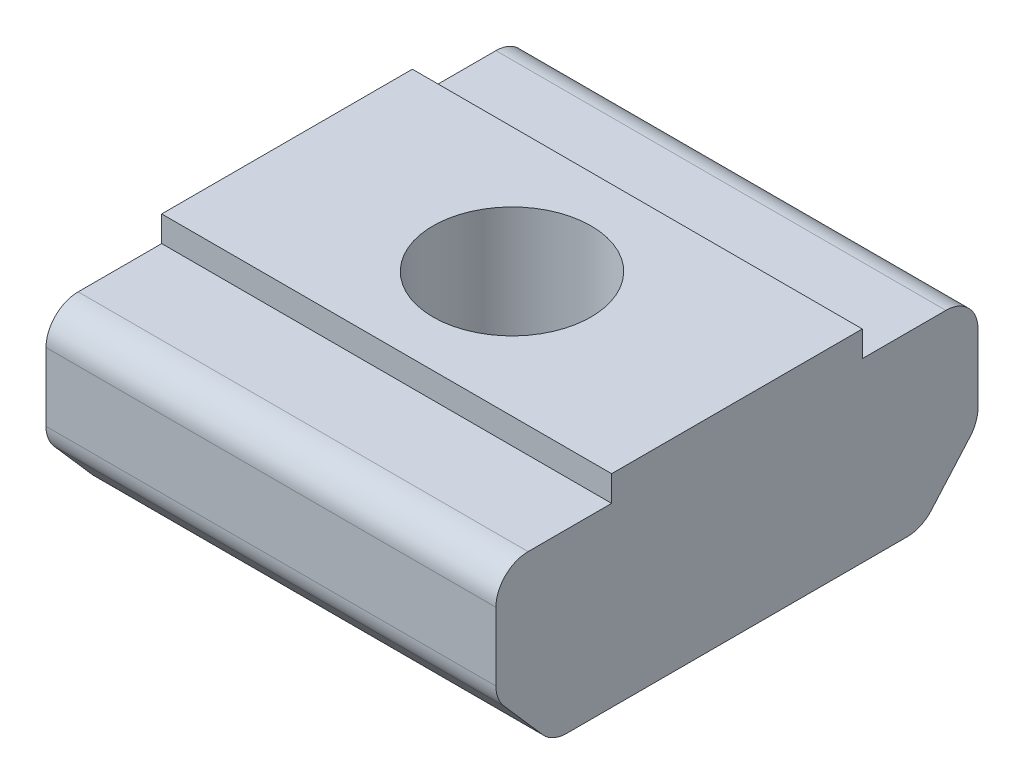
ISO-10303-21;
HEADER;
FILE_DESCRIPTION(('STEP AP214'),'2;1');
FILE_NAME('part.step','',(''),(''),'','','');
FILE_SCHEMA(('AUTOMOTIVE_DESIGN { 1 0 10303 214 1 1 1 1 }'));
ENDSEC;
DATA;
#1=APPLICATION_CONTEXT('core data for automotive mechanical design processes');
#2=APPLICATION_PROTOCOL_DEFINITION('international standard','automotive_design',2000,#1);
#3=PRODUCT_CONTEXT('',#1,'mechanical');
#4=PRODUCT('Part','Part','',(#3));
#5=PRODUCT_RELATED_PRODUCT_CATEGORY('part','',(#4));
#6=PRODUCT_DEFINITION_FORMATION('','',#4);
#7=PRODUCT_DEFINITION_CONTEXT('part definition',#1,'design');
#8=PRODUCT_DEFINITION('design','',#6,#7);
#9=PRODUCT_DEFINITION_SHAPE('','',#8);
#10=(LENGTH_UNIT() NAMED_UNIT(*) SI_UNIT(.MILLI.,.METRE.));
#11=(NAMED_UNIT(*) PLANE_ANGLE_UNIT() SI_UNIT($,.RADIAN.));
#12=(NAMED_UNIT(*) SI_UNIT($,.STERADIAN.) SOLID_ANGLE_UNIT());
#13=UNCERTAINTY_MEASURE_WITH_UNIT(LENGTH_MEASURE(1.E-05),#10,'distance_accuracy_value','');
#14=(GEOMETRIC_REPRESENTATION_CONTEXT(3) GLOBAL_UNCERTAINTY_ASSIGNED_CONTEXT((#13)) GLOBAL_UNIT_ASSIGNED_CONTEXT((#10,
#11,#12)) REPRESENTATION_CONTEXT('',''));
#15=CARTESIAN_POINT('',(0.,0.,0.));
#16=DIRECTION('',(0.,0.,1.));
#17=DIRECTION('',(1.,0.,0.));
#18=AXIS2_PLACEMENT_3D('',#15,#16,#17);
#19=CARTESIAN_POINT('',(7.,0.,3.9));
#20=DIRECTION('',(0.,-1.,0.));
#21=DIRECTION('',(0.,0.,-1.));
#22=AXIS2_PLACEMENT_3D('',#19,#20,#21);
#23=PLANE('',#22);
#24=DIRECTION('',(0.,0.,1.));
#25=VECTOR('',#24,1.);
#26=CARTESIAN_POINT('',(-7.,0.,3.9));
#27=LINE('',#26,#25);
#28=CARTESIAN_POINT('',(-7.,0.,-3.9));
#29=VERTEX_POINT('',#28);
#30=CARTESIAN_POINT('',(-7.,0.,3.9));
#31=VERTEX_POINT('',#30);
#32=EDGE_CURVE('E172',#29,#31,#27,.T.);
#33=ORIENTED_EDGE('',*,*,#32,.T.);
#34=DIRECTION('',(-1.,0.,0.));
#35=VECTOR('',#34,1.);
#36=CARTESIAN_POINT('',(7.,0.,3.9));
#37=LINE('',#36,#35);
#38=CARTESIAN_POINT('',(7.,0.,3.9));
#39=VERTEX_POINT('',#38);
#40=EDGE_CURVE('E253',#39,#31,#37,.T.);
#41=ORIENTED_EDGE('',*,*,#40,.F.);
#42=DIRECTION('',(0.,0.,1.));
#43=VECTOR('',#42,1.);
#44=CARTESIAN_POINT('',(7.,0.,3.9));
#45=LINE('',#44,#43);
#46=CARTESIAN_POINT('',(7.,0.,-3.9));
#47=VERTEX_POINT('',#46);
#48=EDGE_CURVE('E168',#47,#39,#45,.T.);
#49=ORIENTED_EDGE('',*,*,#48,.F.);
#50=DIRECTION('',(-1.,0.,0.));
#51=VECTOR('',#50,1.);
#52=CARTESIAN_POINT('',(7.,0.,-3.9));
#53=LINE('',#52,#51);
#54=EDGE_CURVE('E183',#47,#29,#53,.T.);
#55=ORIENTED_EDGE('',*,*,#54,.T.);
#56=EDGE_LOOP('',(#33,#41,#49,#55));
#57=FACE_BOUND('',#56,.T.);
#58=CARTESIAN_POINT('',(0.,0.,0.));
#59=DIRECTION('',(0.,1.,0.));
#60=DIRECTION('',(0.,0.,1.));
#61=AXIS2_PLACEMENT_3D('',#58,#59,#60);
#62=CIRCLE('',#61,2.4585);
#63=CARTESIAN_POINT('',(0.,0.,2.4585));
#64=VERTEX_POINT('',#63);
#65=EDGE_CURVE('E268',#64,#64,#62,.T.);
#66=ORIENTED_EDGE('',*,*,#65,.F.);
#67=EDGE_LOOP('',(#66));
#68=FACE_BOUND('',#67,.T.);
#69=ADVANCED_FACE('F37',(#57,#68),#23,.F.);
#70=CARTESIAN_POINT('',(7.,-0.800000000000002,3.9));
#71=DIRECTION('',(0.,0.,-1.));
#72=DIRECTION('',(-1.,0.,0.));
#73=AXIS2_PLACEMENT_3D('',#70,#71,#72);
#74=PLANE('',#73);
#75=DIRECTION('',(0.,-1.,0.));
#76=VECTOR('',#75,1.);
#77=CARTESIAN_POINT('',(-7.,-0.800000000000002,3.9));
#78=LINE('',#77,#76);
#79=CARTESIAN_POINT('',(-7.,-0.800000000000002,3.9));
#80=VERTEX_POINT('',#79);
#81=EDGE_CURVE('E176',#31,#80,#78,.T.);
#82=ORIENTED_EDGE('',*,*,#81,.T.);
#83=DIRECTION('',(-1.,0.,0.));
#84=VECTOR('',#83,1.);
#85=CARTESIAN_POINT('',(7.,-0.800000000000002,3.9));
#86=LINE('',#85,#84);
#87=CARTESIAN_POINT('',(7.,-0.800000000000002,3.9));
#88=VERTEX_POINT('',#87);
#89=EDGE_CURVE('E157',#88,#80,#86,.T.);
#90=ORIENTED_EDGE('',*,*,#89,.F.);
#91=DIRECTION('',(0.,-1.,0.));
#92=VECTOR('',#91,1.);
#93=CARTESIAN_POINT('',(7.,-0.800000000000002,3.9));
#94=LINE('',#93,#92);
#95=EDGE_CURVE('E163',#39,#88,#94,.T.);
#96=ORIENTED_EDGE('',*,*,#95,.F.);
#97=ORIENTED_EDGE('',*,*,#40,.T.);
#98=EDGE_LOOP('',(#82,#90,#96,#97));
#99=FACE_BOUND('',#98,.T.);
#100=ADVANCED_FACE('F174',(#99),#74,.F.);
#101=CARTESIAN_POINT('',(7.,-0.800000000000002,7.5));
#102=DIRECTION('',(0.,-1.,0.));
#103=DIRECTION('',(0.,0.,-1.));
#104=AXIS2_PLACEMENT_3D('',#101,#102,#103);
#105=PLANE('',#104);
#106=DIRECTION('',(0.,0.,1.));
#107=VECTOR('',#106,1.);
#108=CARTESIAN_POINT('',(-7.,-0.800000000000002,7.5));
#109=LINE('',#108,#107);
#110=CARTESIAN_POINT('',(-7.,-0.800000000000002,6.5));
#111=VERTEX_POINT('',#110);
#112=EDGE_CURVE('E262',#80,#111,#109,.T.);
#113=ORIENTED_EDGE('',*,*,#112,.T.);
#114=DIRECTION('',(-1.,0.,0.));
#115=VECTOR('',#114,1.);
#116=CARTESIAN_POINT('',(7.,-0.800000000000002,6.5));
#117=LINE('',#116,#115);
#118=CARTESIAN_POINT('',(7.,-0.800000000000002,6.5));
#119=VERTEX_POINT('',#118);
#120=EDGE_CURVE('E160',#111,#119,#117,.F.);
#121=ORIENTED_EDGE('',*,*,#120,.T.);
#122=DIRECTION('',(0.,0.,1.));
#123=VECTOR('',#122,1.);
#124=CARTESIAN_POINT('',(7.,-0.800000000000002,7.5));
#125=LINE('',#124,#123);
#126=EDGE_CURVE('E152',#88,#119,#125,.T.);
#127=ORIENTED_EDGE('',*,*,#126,.F.);
#128=ORIENTED_EDGE('',*,*,#89,.T.);
#129=EDGE_LOOP('',(#113,#121,#127,#128));
#130=FACE_BOUND('',#129,.T.);
#131=ADVANCED_FACE('F155',(#130),#105,.F.);
#132=CARTESIAN_POINT('',(7.,-0.800000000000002,7.5));
#133=DIRECTION('',(0.,0.,-1.));
#134=DIRECTION('',(0.,1.,0.));
#135=AXIS2_PLACEMENT_3D('',#132,#133,#134);
#136=PLANE('',#135);
#137=DIRECTION('',(0.,-1.,0.));
#138=VECTOR('',#137,1.);
#139=CARTESIAN_POINT('',(7.,-0.800000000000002,7.5));
#140=LINE('',#139,#138);
#141=CARTESIAN_POINT('',(7.,-1.8,7.5));
#142=VERTEX_POINT('',#141);
#143=CARTESIAN_POINT('',(7.,-3.92426488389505,7.5));
#144=VERTEX_POINT('',#143);
#145=EDGE_CURVE('E162',#142,#144,#140,.T.);
#146=ORIENTED_EDGE('',*,*,#145,.F.);
#147=DIRECTION('',(-1.,0.,0.));
#148=VECTOR('',#147,1.);
#149=CARTESIAN_POINT('',(7.,-1.8,7.5));
#150=LINE('',#149,#148);
#151=CARTESIAN_POINT('',(-7.,-1.8,7.5));
#152=VERTEX_POINT('',#151);
#153=EDGE_CURVE('E180',#142,#152,#150,.T.);
#154=ORIENTED_EDGE('',*,*,#153,.T.);
#155=DIRECTION('',(0.,-1.,0.));
#156=VECTOR('',#155,1.);
#157=CARTESIAN_POINT('',(-7.,-0.800000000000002,7.5));
#158=LINE('',#157,#156);
#159=CARTESIAN_POINT('',(-7.,-3.92426488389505,7.5));
#160=VERTEX_POINT('',#159);
#161=EDGE_CURVE('E265',#152,#160,#158,.T.);
#162=ORIENTED_EDGE('',*,*,#161,.T.);
#163=DIRECTION('',(-1.,0.,0.));
#164=VECTOR('',#163,1.);
#165=CARTESIAN_POINT('',(7.,-3.92426488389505,7.5));
#166=LINE('',#165,#164);
#167=EDGE_CURVE('E177',#160,#144,#166,.F.);
#168=ORIENTED_EDGE('',*,*,#167,.T.);
#169=EDGE_LOOP('',(#146,#154,#162,#168));
#170=FACE_BOUND('',#169,.T.);
#171=ADVANCED_FACE('F342',(#170),#136,.F.);
#172=CARTESIAN_POINT('',(7.,-4.3,7.5));
#173=DIRECTION('',(0.,0.658504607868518,-0.752576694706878));
#174=DIRECTION('',(0.,0.752576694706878,0.658504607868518));
#175=AXIS2_PLACEMENT_3D('',#172,#173,#174);
#176=PLANE('',#175);
#177=DIRECTION('',(0.,-0.752576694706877,-0.658504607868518));
#178=VECTOR('',#177,1.);
#179=CARTESIAN_POINT('',(7.,-4.3,7.5));
#180=LINE('',#179,#178);
#181=CARTESIAN_POINT('',(7.,-4.58276949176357,7.25257669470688));
#182=VERTEX_POINT('',#181);
#183=CARTESIAN_POINT('',(7.,-5.95850460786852,6.04880846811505));
#184=VERTEX_POINT('',#183);
#185=EDGE_CURVE('E299',#182,#184,#180,.T.);
#186=ORIENTED_EDGE('',*,*,#185,.F.);
#187=DIRECTION('',(-1.,0.,0.));
#188=VECTOR('',#187,1.);
#189=CARTESIAN_POINT('',(7.,-4.58276949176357,7.25257669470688));
#190=LINE('',#189,#188);
#191=CARTESIAN_POINT('',(-7.,-4.58276949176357,7.25257669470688));
#192=VERTEX_POINT('',#191);
#193=EDGE_CURVE('E215',#182,#192,#190,.T.);
#194=ORIENTED_EDGE('',*,*,#193,.T.);
#195=DIRECTION('',(0.,-0.752576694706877,-0.658504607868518));
#196=VECTOR('',#195,1.);
#197=CARTESIAN_POINT('',(-7.,-4.3,7.5));
#198=LINE('',#197,#196);
#199=CARTESIAN_POINT('',(-7.,-5.95850460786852,6.04880846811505));
#200=VERTEX_POINT('',#199);
#201=EDGE_CURVE('E275',#192,#200,#198,.T.);
#202=ORIENTED_EDGE('',*,*,#201,.T.);
#203=DIRECTION('',(-1.,0.,0.));
#204=VECTOR('',#203,1.);
#205=CARTESIAN_POINT('',(7.,-5.95850460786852,6.04880846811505));
#206=LINE('',#205,#204);
#207=EDGE_CURVE('E213',#200,#184,#206,.F.);
#208=ORIENTED_EDGE('',*,*,#207,.T.);
#209=EDGE_LOOP('',(#186,#194,#202,#208));
#210=FACE_BOUND('',#209,.T.);
#211=ADVANCED_FACE('F338',(#210),#176,.F.);
#212=CARTESIAN_POINT('',(7.,-6.3,-5.75));
#213=DIRECTION('',(0.,1.,0.));
#214=DIRECTION('',(0.,0.,1.));
#215=AXIS2_PLACEMENT_3D('',#212,#213,#214);
#216=PLANE('',#215);
#217=CARTESIAN_POINT('',(0.,-6.3,0.));
#218=DIRECTION('',(0.,1.,0.));
#219=DIRECTION('',(0.,0.,1.));
#220=AXIS2_PLACEMENT_3D('',#217,#218,#219);
#221=CIRCLE('',#220,2.4585);
#222=CARTESIAN_POINT('',(0.,-6.3,2.4585));
#223=VERTEX_POINT('',#222);
#224=EDGE_CURVE('E263',#223,#223,#221,.T.);
#225=ORIENTED_EDGE('',*,*,#224,.T.);
#226=EDGE_LOOP('',(#225));
#227=FACE_BOUND('',#226,.T.);
#228=DIRECTION('',(0.,0.,-1.));
#229=VECTOR('',#228,1.);
#230=CARTESIAN_POINT('',(7.,-6.3,-5.75));
#231=LINE('',#230,#229);
#232=CARTESIAN_POINT('',(7.,-6.3,5.29623177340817));
#233=VERTEX_POINT('',#232);
#234=CARTESIAN_POINT('',(7.,-6.3,-5.29623177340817));
#235=VERTEX_POINT('',#234);
#236=EDGE_CURVE('E292',#233,#235,#231,.T.);
#237=ORIENTED_EDGE('',*,*,#236,.F.);
#238=DIRECTION('',(-1.,0.,0.));
#239=VECTOR('',#238,1.);
#240=CARTESIAN_POINT('',(7.,-6.3,5.29623177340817));
#241=LINE('',#240,#239);
#242=CARTESIAN_POINT('',(-7.,-6.3,5.29623177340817));
#243=VERTEX_POINT('',#242);
#244=EDGE_CURVE('E220',#233,#243,#241,.T.);
#245=ORIENTED_EDGE('',*,*,#244,.T.);
#246=DIRECTION('',(0.,0.,-1.));
#247=VECTOR('',#246,1.);
#248=CARTESIAN_POINT('',(-7.,-6.3,-5.75));
#249=LINE('',#248,#247);
#250=CARTESIAN_POINT('',(-7.,-6.3,-5.29623177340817));
#251=VERTEX_POINT('',#250);
#252=EDGE_CURVE('E247',#243,#251,#249,.T.);
#253=ORIENTED_EDGE('',*,*,#252,.T.);
#254=DIRECTION('',(-1.,0.,0.));
#255=VECTOR('',#254,1.);
#256=CARTESIAN_POINT('',(7.,-6.3,-5.29623177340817));
#257=LINE('',#256,#255);
#258=EDGE_CURVE('E218',#251,#235,#257,.F.);
#259=ORIENTED_EDGE('',*,*,#258,.T.);
#260=EDGE_LOOP('',(#237,#245,#253,#259));
#261=FACE_BOUND('',#260,.T.);
#262=ADVANCED_FACE('F282',(#227,#261),#216,.F.);
#263=CARTESIAN_POINT('',(7.,-4.3,-7.5));
#264=DIRECTION('',(0.,0.658504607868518,0.752576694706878));
#265=DIRECTION('',(0.,-0.752576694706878,0.658504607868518));
#266=AXIS2_PLACEMENT_3D('',#263,#264,#265);
#267=PLANE('',#266);
#268=DIRECTION('',(0.,0.752576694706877,-0.658504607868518));
#269=VECTOR('',#268,1.);
#270=CARTESIAN_POINT('',(7.,-4.3,-7.5));
#271=LINE('',#270,#269);
#272=CARTESIAN_POINT('',(7.,-5.95850460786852,-6.04880846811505));
#273=VERTEX_POINT('',#272);
#274=CARTESIAN_POINT('',(7.,-4.58276949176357,-7.25257669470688));
#275=VERTEX_POINT('',#274);
#276=EDGE_CURVE('E291',#273,#275,#271,.T.);
#277=ORIENTED_EDGE('',*,*,#276,.F.);
#278=DIRECTION('',(-1.,0.,0.));
#279=VECTOR('',#278,1.);
#280=CARTESIAN_POINT('',(7.,-5.95850460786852,-6.04880846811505));
#281=LINE('',#280,#279);
#282=CARTESIAN_POINT('',(-7.,-5.95850460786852,-6.04880846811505));
#283=VERTEX_POINT('',#282);
#284=EDGE_CURVE('E225',#273,#283,#281,.T.);
#285=ORIENTED_EDGE('',*,*,#284,.T.);
#286=DIRECTION('',(0.,0.752576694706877,-0.658504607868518));
#287=VECTOR('',#286,1.);
#288=CARTESIAN_POINT('',(-7.,-4.3,-7.5));
#289=LINE('',#288,#287);
#290=CARTESIAN_POINT('',(-7.,-4.58276949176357,-7.25257669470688));
#291=VERTEX_POINT('',#290);
#292=EDGE_CURVE('E243',#283,#291,#289,.T.);
#293=ORIENTED_EDGE('',*,*,#292,.T.);
#294=DIRECTION('',(-1.,0.,0.));
#295=VECTOR('',#294,1.);
#296=CARTESIAN_POINT('',(7.,-4.58276949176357,-7.25257669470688));
#297=LINE('',#296,#295);
#298=EDGE_CURVE('E223',#291,#275,#297,.F.);
#299=ORIENTED_EDGE('',*,*,#298,.T.);
#300=EDGE_LOOP('',(#277,#285,#293,#299));
#301=FACE_BOUND('',#300,.T.);
#302=ADVANCED_FACE('F294',(#301),#267,.F.);
#303=CARTESIAN_POINT('',(7.,-0.8,-7.5));
#304=DIRECTION('',(0.,0.,1.));
#305=DIRECTION('',(0.,-1.,0.));
#306=AXIS2_PLACEMENT_3D('',#303,#304,#305);
#307=PLANE('',#306);
#308=DIRECTION('',(0.,1.,0.));
#309=VECTOR('',#308,1.);
#310=CARTESIAN_POINT('',(7.,-0.8,-7.5));
#311=LINE('',#310,#309);
#312=CARTESIAN_POINT('',(7.,-3.92426488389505,-7.5));
#313=VERTEX_POINT('',#312);
#314=CARTESIAN_POINT('',(7.,-1.8,-7.5));
#315=VERTEX_POINT('',#314);
#316=EDGE_CURVE('E233',#313,#315,#311,.T.);
#317=ORIENTED_EDGE('',*,*,#316,.F.);
#318=DIRECTION('',(-1.,0.,0.));
#319=VECTOR('',#318,1.);
#320=CARTESIAN_POINT('',(7.,-3.92426488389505,-7.5));
#321=LINE('',#320,#319);
#322=CARTESIAN_POINT('',(-7.,-3.92426488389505,-7.5));
#323=VERTEX_POINT('',#322);
#324=EDGE_CURVE('E45',#313,#323,#321,.T.);
#325=ORIENTED_EDGE('',*,*,#324,.T.);
#326=DIRECTION('',(0.,1.,0.));
#327=VECTOR('',#326,1.);
#328=CARTESIAN_POINT('',(-7.,-0.8,-7.5));
#329=LINE('',#328,#327);
#330=CARTESIAN_POINT('',(-7.,-1.8,-7.5));
#331=VERTEX_POINT('',#330);
#332=EDGE_CURVE('E232',#323,#331,#329,.T.);
#333=ORIENTED_EDGE('',*,*,#332,.T.);
#334=DIRECTION('',(-1.,0.,0.));
#335=VECTOR('',#334,1.);
#336=CARTESIAN_POINT('',(7.,-1.8,-7.5));
#337=LINE('',#336,#335);
#338=EDGE_CURVE('E60',#331,#315,#337,.F.);
#339=ORIENTED_EDGE('',*,*,#338,.T.);
#340=EDGE_LOOP('',(#317,#325,#333,#339));
#341=FACE_BOUND('',#340,.T.);
#342=ADVANCED_FACE('F231',(#341),#307,.F.);
#343=CARTESIAN_POINT('',(7.,-0.800000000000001,-3.9));
#344=DIRECTION('',(0.,-1.,0.));
#345=DIRECTION('',(0.,0.,-1.));
#346=AXIS2_PLACEMENT_3D('',#343,#344,#345);
#347=PLANE('',#346);
#348=DIRECTION('',(0.,0.,1.));
#349=VECTOR('',#348,1.);
#350=CARTESIAN_POINT('',(7.,-0.800000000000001,-3.9));
#351=LINE('',#350,#349);
#352=CARTESIAN_POINT('',(7.,-0.8,-6.5));
#353=VERTEX_POINT('',#352);
#354=CARTESIAN_POINT('',(7.,-0.800000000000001,-3.9));
#355=VERTEX_POINT('',#354);
#356=EDGE_CURVE('E297',#353,#355,#351,.T.);
#357=ORIENTED_EDGE('',*,*,#356,.F.);
#358=DIRECTION('',(-1.,0.,0.));
#359=VECTOR('',#358,1.);
#360=CARTESIAN_POINT('',(7.,-0.8,-6.5));
#361=LINE('',#360,#359);
#362=CARTESIAN_POINT('',(-7.,-0.8,-6.5));
#363=VERTEX_POINT('',#362);
#364=EDGE_CURVE('E11',#353,#363,#361,.T.);
#365=ORIENTED_EDGE('',*,*,#364,.T.);
#366=DIRECTION('',(0.,0.,1.));
#367=VECTOR('',#366,1.);
#368=CARTESIAN_POINT('',(-7.,-0.800000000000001,-3.9));
#369=LINE('',#368,#367);
#370=CARTESIAN_POINT('',(-7.,-0.800000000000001,-3.9));
#371=VERTEX_POINT('',#370);
#372=EDGE_CURVE('E242',#363,#371,#369,.T.);
#373=ORIENTED_EDGE('',*,*,#372,.T.);
#374=DIRECTION('',(-1.,0.,0.));
#375=VECTOR('',#374,1.);
#376=CARTESIAN_POINT('',(7.,-0.800000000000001,-3.9));
#377=LINE('',#376,#375);
#378=EDGE_CURVE('E178',#355,#371,#377,.T.);
#379=ORIENTED_EDGE('',*,*,#378,.F.);
#380=EDGE_LOOP('',(#357,#365,#373,#379));
#381=FACE_BOUND('',#380,.T.);
#382=ADVANCED_FACE('F307',(#381),#347,.F.);
#383=CARTESIAN_POINT('',(7.,0.,-3.9));
#384=DIRECTION('',(0.,0.,1.));
#385=DIRECTION('',(1.,0.,0.));
#386=AXIS2_PLACEMENT_3D('',#383,#384,#385);
#387=PLANE('',#386);
#388=DIRECTION('',(0.,1.,0.));
#389=VECTOR('',#388,1.);
#390=CARTESIAN_POINT('',(-7.,0.,-3.9));
#391=LINE('',#390,#389);
#392=EDGE_CURVE('E245',#371,#29,#391,.T.);
#393=ORIENTED_EDGE('',*,*,#392,.T.);
#394=ORIENTED_EDGE('',*,*,#54,.F.);
#395=DIRECTION('',(0.,1.,0.));
#396=VECTOR('',#395,1.);
#397=CARTESIAN_POINT('',(7.,0.,-3.9));
#398=LINE('',#397,#396);
#399=EDGE_CURVE('E303',#355,#47,#398,.T.);
#400=ORIENTED_EDGE('',*,*,#399,.F.);
#401=ORIENTED_EDGE('',*,*,#378,.T.);
#402=EDGE_LOOP('',(#393,#394,#400,#401));
#403=FACE_BOUND('',#402,.T.);
#404=ADVANCED_FACE('F305',(#403),#387,.F.);
#405=CARTESIAN_POINT('',(7.,0.,0.));
#406=DIRECTION('',(-1.,0.,0.));
#407=DIRECTION('',(0.,0.,1.));
#408=AXIS2_PLACEMENT_3D('',#405,#406,#407);
#409=PLANE('',#408);
#410=ORIENTED_EDGE('',*,*,#126,.T.);
#411=CARTESIAN_POINT('',(7.,-1.8,6.5));
#412=DIRECTION('',(-1.,0.,0.));
#413=DIRECTION('',(0.,0.,1.));
#414=AXIS2_PLACEMENT_3D('',#411,#412,#413);
#415=CIRCLE('',#414,1.);
#416=EDGE_CURVE('E211',#119,#142,#415,.F.);
#417=ORIENTED_EDGE('',*,*,#416,.T.);
#418=ORIENTED_EDGE('',*,*,#145,.T.);
#419=CARTESIAN_POINT('',(7.,-3.92426488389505,6.5));
#420=DIRECTION('',(-1.,0.,0.));
#421=DIRECTION('',(0.,0.,1.));
#422=AXIS2_PLACEMENT_3D('',#419,#420,#421);
#423=CIRCLE('',#422,1.);
#424=EDGE_CURVE('E209',#144,#182,#423,.F.);
#425=ORIENTED_EDGE('',*,*,#424,.T.);
#426=ORIENTED_EDGE('',*,*,#185,.T.);
#427=CARTESIAN_POINT('',(7.,-5.3,5.29623177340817));
#428=DIRECTION('',(-1.,0.,0.));
#429=DIRECTION('',(0.,0.,1.));
#430=AXIS2_PLACEMENT_3D('',#427,#428,#429);
#431=CIRCLE('',#430,1.);
#432=EDGE_CURVE('E207',#184,#233,#431,.F.);
#433=ORIENTED_EDGE('',*,*,#432,.T.);
#434=ORIENTED_EDGE('',*,*,#236,.T.);
#435=CARTESIAN_POINT('',(7.,-5.3,-5.29623177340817));
#436=DIRECTION('',(-1.,0.,0.));
#437=DIRECTION('',(0.,0.,1.));
#438=AXIS2_PLACEMENT_3D('',#435,#436,#437);
#439=CIRCLE('',#438,1.);
#440=EDGE_CURVE('E205',#235,#273,#439,.F.);
#441=ORIENTED_EDGE('',*,*,#440,.T.);
#442=ORIENTED_EDGE('',*,*,#276,.T.);
#443=CARTESIAN_POINT('',(7.,-3.92426488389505,-6.5));
#444=DIRECTION('',(-1.,0.,0.));
#445=DIRECTION('',(0.,0.,1.));
#446=AXIS2_PLACEMENT_3D('',#443,#444,#445);
#447=CIRCLE('',#446,1.);
#448=EDGE_CURVE('E203',#275,#313,#447,.F.);
#449=ORIENTED_EDGE('',*,*,#448,.T.);
#450=ORIENTED_EDGE('',*,*,#316,.T.);
#451=CARTESIAN_POINT('',(7.,-1.8,-6.5));
#452=DIRECTION('',(-1.,0.,0.));
#453=DIRECTION('',(0.,0.,1.));
#454=AXIS2_PLACEMENT_3D('',#451,#452,#453);
#455=CIRCLE('',#454,1.);
#456=EDGE_CURVE('E52',#315,#353,#455,.F.);
#457=ORIENTED_EDGE('',*,*,#456,.T.);
#458=ORIENTED_EDGE('',*,*,#356,.T.);
#459=ORIENTED_EDGE('',*,*,#399,.T.);
#460=ORIENTED_EDGE('',*,*,#48,.T.);
#461=ORIENTED_EDGE('',*,*,#95,.T.);
#462=EDGE_LOOP('',(#410,#417,#418,#425,#426,#433,#434,#441,#442,#449,#450,#457,#458,#459,#460,#461));
#463=FACE_BOUND('',#462,.T.);
#464=ADVANCED_FACE('F166',(#463),#409,.F.);
#465=CARTESIAN_POINT('',(-7.,0.,0.));
#466=DIRECTION('',(-1.,0.,0.));
#467=DIRECTION('',(0.,0.,1.));
#468=AXIS2_PLACEMENT_3D('',#465,#466,#467);
#469=PLANE('',#468);
#470=ORIENTED_EDGE('',*,*,#161,.F.);
#471=CARTESIAN_POINT('',(-7.,-1.8,6.5));
#472=DIRECTION('',(-1.,0.,0.));
#473=DIRECTION('',(0.,0.,1.));
#474=AXIS2_PLACEMENT_3D('',#471,#472,#473);
#475=CIRCLE('',#474,1.);
#476=EDGE_CURVE('E199',#152,#111,#475,.T.);
#477=ORIENTED_EDGE('',*,*,#476,.T.);
#478=ORIENTED_EDGE('',*,*,#112,.F.);
#479=ORIENTED_EDGE('',*,*,#81,.F.);
#480=ORIENTED_EDGE('',*,*,#32,.F.);
#481=ORIENTED_EDGE('',*,*,#392,.F.);
#482=ORIENTED_EDGE('',*,*,#372,.F.);
#483=CARTESIAN_POINT('',(-7.,-1.8,-6.5));
#484=DIRECTION('',(-1.,0.,0.));
#485=DIRECTION('',(0.,0.,1.));
#486=AXIS2_PLACEMENT_3D('',#483,#484,#485);
#487=CIRCLE('',#486,1.);
#488=EDGE_CURVE('E189',#363,#331,#487,.T.);
#489=ORIENTED_EDGE('',*,*,#488,.T.);
#490=ORIENTED_EDGE('',*,*,#332,.F.);
#491=CARTESIAN_POINT('',(-7.,-3.92426488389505,-6.5));
#492=DIRECTION('',(-1.,0.,0.));
#493=DIRECTION('',(0.,0.,1.));
#494=AXIS2_PLACEMENT_3D('',#491,#492,#493);
#495=CIRCLE('',#494,1.);
#496=EDGE_CURVE('E191',#323,#291,#495,.T.);
#497=ORIENTED_EDGE('',*,*,#496,.T.);
#498=ORIENTED_EDGE('',*,*,#292,.F.);
#499=CARTESIAN_POINT('',(-7.,-5.3,-5.29623177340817));
#500=DIRECTION('',(-1.,0.,0.));
#501=DIRECTION('',(0.,0.,1.));
#502=AXIS2_PLACEMENT_3D('',#499,#500,#501);
#503=CIRCLE('',#502,1.);
#504=EDGE_CURVE('E193',#283,#251,#503,.T.);
#505=ORIENTED_EDGE('',*,*,#504,.T.);
#506=ORIENTED_EDGE('',*,*,#252,.F.);
#507=CARTESIAN_POINT('',(-7.,-5.3,5.29623177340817));
#508=DIRECTION('',(-1.,0.,0.));
#509=DIRECTION('',(0.,0.,1.));
#510=AXIS2_PLACEMENT_3D('',#507,#508,#509);
#511=CIRCLE('',#510,1.);
#512=EDGE_CURVE('E195',#243,#200,#511,.T.);
#513=ORIENTED_EDGE('',*,*,#512,.T.);
#514=ORIENTED_EDGE('',*,*,#201,.F.);
#515=CARTESIAN_POINT('',(-7.,-3.92426488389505,6.5));
#516=DIRECTION('',(-1.,0.,0.));
#517=DIRECTION('',(0.,0.,1.));
#518=AXIS2_PLACEMENT_3D('',#515,#516,#517);
#519=CIRCLE('',#518,1.);
#520=EDGE_CURVE('E197',#192,#160,#519,.T.);
#521=ORIENTED_EDGE('',*,*,#520,.T.);
#522=EDGE_LOOP('',(#470,#477,#478,#479,#480,#481,#482,#489,#490,#497,#498,#505,#506,#513,#514,#521));
#523=FACE_BOUND('',#522,.T.);
#524=ADVANCED_FACE('F238',(#523),#469,.T.);
#525=CARTESIAN_POINT('',(7.,-1.8,6.5));
#526=DIRECTION('',(-1.,0.,0.));
#527=DIRECTION('',(0.,0.,1.));
#528=AXIS2_PLACEMENT_3D('',#525,#526,#527);
#529=CYLINDRICAL_SURFACE('',#528,1.);
#530=ORIENTED_EDGE('',*,*,#416,.F.);
#531=ORIENTED_EDGE('',*,*,#120,.F.);
#532=ORIENTED_EDGE('',*,*,#476,.F.);
#533=ORIENTED_EDGE('',*,*,#153,.F.);
#534=EDGE_LOOP('',(#530,#531,#532,#533));
#535=FACE_BOUND('',#534,.T.);
#536=ADVANCED_FACE('F349',(#535),#529,.T.);
#537=CARTESIAN_POINT('',(7.,-3.92426488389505,6.5));
#538=DIRECTION('',(-1.,0.,0.));
#539=DIRECTION('',(0.,0.,1.));
#540=AXIS2_PLACEMENT_3D('',#537,#538,#539);
#541=CYLINDRICAL_SURFACE('',#540,1.);
#542=ORIENTED_EDGE('',*,*,#424,.F.);
#543=ORIENTED_EDGE('',*,*,#167,.F.);
#544=ORIENTED_EDGE('',*,*,#520,.F.);
#545=ORIENTED_EDGE('',*,*,#193,.F.);
#546=EDGE_LOOP('',(#542,#543,#544,#545));
#547=FACE_BOUND('',#546,.T.);
#548=ADVANCED_FACE('F352',(#547),#541,.T.);
#549=CARTESIAN_POINT('',(7.,-5.3,5.29623177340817));
#550=DIRECTION('',(-1.,0.,0.));
#551=DIRECTION('',(0.,0.,1.));
#552=AXIS2_PLACEMENT_3D('',#549,#550,#551);
#553=CYLINDRICAL_SURFACE('',#552,1.);
#554=ORIENTED_EDGE('',*,*,#432,.F.);
#555=ORIENTED_EDGE('',*,*,#207,.F.);
#556=ORIENTED_EDGE('',*,*,#512,.F.);
#557=ORIENTED_EDGE('',*,*,#244,.F.);
#558=EDGE_LOOP('',(#554,#555,#556,#557));
#559=FACE_BOUND('',#558,.T.);
#560=ADVANCED_FACE('F356',(#559),#553,.T.);
#561=CARTESIAN_POINT('',(7.,-5.3,-5.29623177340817));
#562=DIRECTION('',(-1.,0.,0.));
#563=DIRECTION('',(0.,0.,1.));
#564=AXIS2_PLACEMENT_3D('',#561,#562,#563);
#565=CYLINDRICAL_SURFACE('',#564,1.);
#566=ORIENTED_EDGE('',*,*,#440,.F.);
#567=ORIENTED_EDGE('',*,*,#258,.F.);
#568=ORIENTED_EDGE('',*,*,#504,.F.);
#569=ORIENTED_EDGE('',*,*,#284,.F.);
#570=EDGE_LOOP('',(#566,#567,#568,#569));
#571=FACE_BOUND('',#570,.T.);
#572=ADVANCED_FACE('F287',(#571),#565,.T.);
#573=CARTESIAN_POINT('',(7.,-3.92426488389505,-6.5));
#574=DIRECTION('',(-1.,0.,0.));
#575=DIRECTION('',(0.,0.,1.));
#576=AXIS2_PLACEMENT_3D('',#573,#574,#575);
#577=CYLINDRICAL_SURFACE('',#576,1.);
#578=ORIENTED_EDGE('',*,*,#448,.F.);
#579=ORIENTED_EDGE('',*,*,#298,.F.);
#580=ORIENTED_EDGE('',*,*,#496,.F.);
#581=ORIENTED_EDGE('',*,*,#324,.F.);
#582=EDGE_LOOP('',(#578,#579,#580,#581));
#583=FACE_BOUND('',#582,.T.);
#584=ADVANCED_FACE('F312',(#583),#577,.T.);
#585=CARTESIAN_POINT('',(7.,-1.8,-6.5));
#586=DIRECTION('',(-1.,0.,0.));
#587=DIRECTION('',(0.,0.,1.));
#588=AXIS2_PLACEMENT_3D('',#585,#586,#587);
#589=CYLINDRICAL_SURFACE('',#588,1.);
#590=ORIENTED_EDGE('',*,*,#456,.F.);
#591=ORIENTED_EDGE('',*,*,#338,.F.);
#592=ORIENTED_EDGE('',*,*,#488,.F.);
#593=ORIENTED_EDGE('',*,*,#364,.F.);
#594=EDGE_LOOP('',(#590,#591,#592,#593));
#595=FACE_BOUND('',#594,.T.);
#596=ADVANCED_FACE('F39',(#595),#589,.T.);
#597=CARTESIAN_POINT('',(0.,0.,0.));
#598=DIRECTION('',(0.,1.,0.));
#599=DIRECTION('',(0.,0.,1.));
#600=AXIS2_PLACEMENT_3D('',#597,#598,#599);
#601=CYLINDRICAL_SURFACE('',#600,2.4585);
#602=ORIENTED_EDGE('',*,*,#224,.F.);
#603=EDGE_LOOP('',(#602));
#604=FACE_BOUND('',#603,.T.);
#605=ORIENTED_EDGE('',*,*,#65,.T.);
#606=EDGE_LOOP('',(#605));
#607=FACE_BOUND('',#606,.T.);
#608=ADVANCED_FACE('F311',(#604,#607),#601,.F.);
#609=CLOSED_SHELL('',(#69,#100,#131,#171,#211,#262,#302,#342,#382,#404,#464,#524,#536,#548,#560,
#572,#584,#596,#608));
#610=MANIFOLD_SOLID_BREP('B2',#609);
#611=ADVANCED_BREP_SHAPE_REPRESENTATION('',(#18,#610),#14);
#612=SHAPE_DEFINITION_REPRESENTATION(#9,#611);
ENDSEC;
END-ISO-10303-21;
